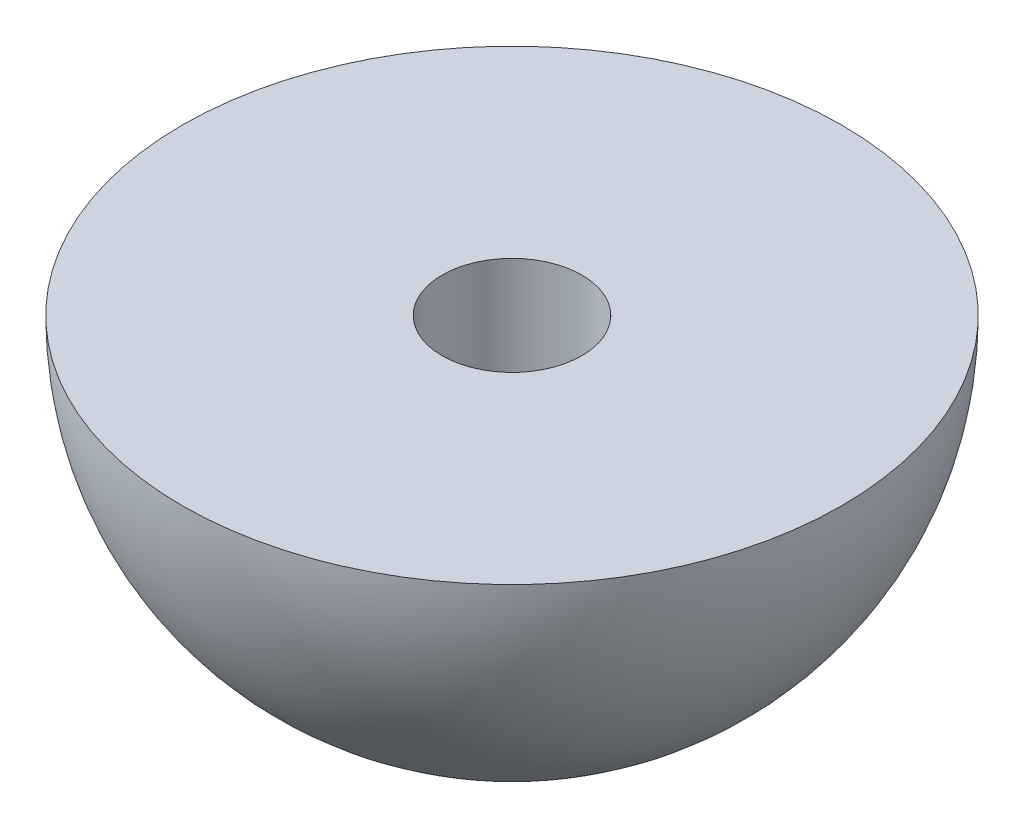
ISO-10303-21;
HEADER;
FILE_DESCRIPTION(('STEP AP214'),'2;1');
FILE_NAME('part.step','',(''),(''),'','','');
FILE_SCHEMA(('AUTOMOTIVE_DESIGN { 1 0 10303 214 1 1 1 1 }'));
ENDSEC;
DATA;
#1=APPLICATION_CONTEXT('core data for automotive mechanical design processes');
#2=APPLICATION_PROTOCOL_DEFINITION('international standard','automotive_design',2000,#1);
#3=PRODUCT_CONTEXT('',#1,'mechanical');
#4=PRODUCT('Part','Part','',(#3));
#5=PRODUCT_RELATED_PRODUCT_CATEGORY('part','',(#4));
#6=PRODUCT_DEFINITION_FORMATION('','',#4);
#7=PRODUCT_DEFINITION_CONTEXT('part definition',#1,'design');
#8=PRODUCT_DEFINITION('design','',#6,#7);
#9=PRODUCT_DEFINITION_SHAPE('','',#8);
#10=(LENGTH_UNIT() NAMED_UNIT(*) SI_UNIT(.MILLI.,.METRE.));
#11=(NAMED_UNIT(*) PLANE_ANGLE_UNIT() SI_UNIT($,.RADIAN.));
#12=(NAMED_UNIT(*) SI_UNIT($,.STERADIAN.) SOLID_ANGLE_UNIT());
#13=UNCERTAINTY_MEASURE_WITH_UNIT(LENGTH_MEASURE(1.E-05),#10,'distance_accuracy_value','');
#14=(GEOMETRIC_REPRESENTATION_CONTEXT(3) GLOBAL_UNCERTAINTY_ASSIGNED_CONTEXT((#13)) GLOBAL_UNIT_ASSIGNED_CONTEXT((#10,
#11,#12)) REPRESENTATION_CONTEXT('',''));
#15=CARTESIAN_POINT('',(0.,0.,0.));
#16=DIRECTION('',(0.,0.,1.));
#17=DIRECTION('',(1.,0.,0.));
#18=AXIS2_PLACEMENT_3D('',#15,#16,#17);
#19=CARTESIAN_POINT('',(0.,0.,0.));
#20=DIRECTION('',(0.,1.,0.));
#21=DIRECTION('',(0.,0.,1.));
#22=AXIS2_PLACEMENT_3D('',#19,#20,#21);
#23=PLANE('',#22);
#24=CARTESIAN_POINT('',(0.,0.,0.));
#25=DIRECTION('',(0.,1.,0.));
#26=DIRECTION('',(0.,0.,1.));
#27=AXIS2_PLACEMENT_3D('',#24,#25,#26);
#28=CIRCLE('',#27,2.01929999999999);
#29=CARTESIAN_POINT('',(0.,0.,2.01929999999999));
#30=VERTEX_POINT('',#29);
#31=EDGE_CURVE('E68',#30,#30,#28,.T.);
#32=ORIENTED_EDGE('',*,*,#31,.F.);
#33=EDGE_LOOP('',(#32));
#34=FACE_BOUND('',#33,.T.);
#35=CARTESIAN_POINT('',(0.,0.,0.));
#36=DIRECTION('',(0.,1.,0.));
#37=DIRECTION('',(0.,0.,1.));
#38=AXIS2_PLACEMENT_3D('',#35,#36,#37);
#39=CIRCLE('',#38,9.525);
#40=CARTESIAN_POINT('',(0.,0.,9.525));
#41=VERTEX_POINT('',#40);
#42=EDGE_CURVE('E13',#41,#41,#39,.T.);
#43=ORIENTED_EDGE('',*,*,#42,.T.);
#44=EDGE_LOOP('',(#43));
#45=FACE_BOUND('',#44,.T.);
#46=ADVANCED_FACE('F50',(#34,#45),#23,.T.);
#47=CARTESIAN_POINT('',(0.,0.,0.));
#48=DIRECTION('',(0.,1.,0.));
#49=DIRECTION('',(-1.,0.,0.));
#50=AXIS2_PLACEMENT_3D('',#47,#48,#49);
#51=SPHERICAL_SURFACE('',#50,9.525);
#52=ORIENTED_EDGE('',*,*,#42,.F.);
#53=EDGE_LOOP('',(#52));
#54=FACE_BOUND('',#53,.T.);
#55=ADVANCED_FACE('F63',(#54),#51,.T.);
#56=CARTESIAN_POINT('',(0.,-6.604,0.));
#57=DIRECTION('',(0.,1.,0.));
#58=DIRECTION('',(0.,0.,1.));
#59=AXIS2_PLACEMENT_3D('',#56,#57,#58);
#60=CONICAL_SURFACE('',#59,2.0193,1.02974425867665);
#61=CARTESIAN_POINT('',(0.,-7.81731784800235,0.));
#62=VERTEX_POINT('',#61);
#63=VERTEX_LOOP('',#62);
#64=FACE_BOUND('',#63,.T.);
#65=CARTESIAN_POINT('',(0.,-6.604,0.));
#66=DIRECTION('',(0.,1.,0.));
#67=DIRECTION('',(0.,0.,1.));
#68=AXIS2_PLACEMENT_3D('',#65,#66,#67);
#69=CIRCLE('',#68,2.0193);
#70=CARTESIAN_POINT('',(0.,-6.604,2.0193));
#71=VERTEX_POINT('',#70);
#72=EDGE_CURVE('E56',#71,#71,#69,.T.);
#73=ORIENTED_EDGE('',*,*,#72,.T.);
#74=EDGE_LOOP('',(#73));
#75=FACE_BOUND('',#74,.T.);
#76=ADVANCED_FACE('F59',(#64,#75),#60,.F.);
#77=CARTESIAN_POINT('',(0.,0.,0.));
#78=DIRECTION('',(0.,1.,0.));
#79=DIRECTION('',(0.,0.,1.));
#80=AXIS2_PLACEMENT_3D('',#77,#78,#79);
#81=CYLINDRICAL_SURFACE('',#80,2.01929999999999);
#82=ORIENTED_EDGE('',*,*,#72,.F.);
#83=EDGE_LOOP('',(#82));
#84=FACE_BOUND('',#83,.T.);
#85=ORIENTED_EDGE('',*,*,#31,.T.);
#86=EDGE_LOOP('',(#85));
#87=FACE_BOUND('',#86,.T.);
#88=ADVANCED_FACE('F62',(#84,#87),#81,.F.);
#89=CLOSED_SHELL('',(#46,#55,#76,#88));
#90=MANIFOLD_SOLID_BREP('B2',#89);
#91=ADVANCED_BREP_SHAPE_REPRESENTATION('',(#18,#90),#14);
#92=SHAPE_DEFINITION_REPRESENTATION(#9,#91);
ENDSEC;
END-ISO-10303-21;
